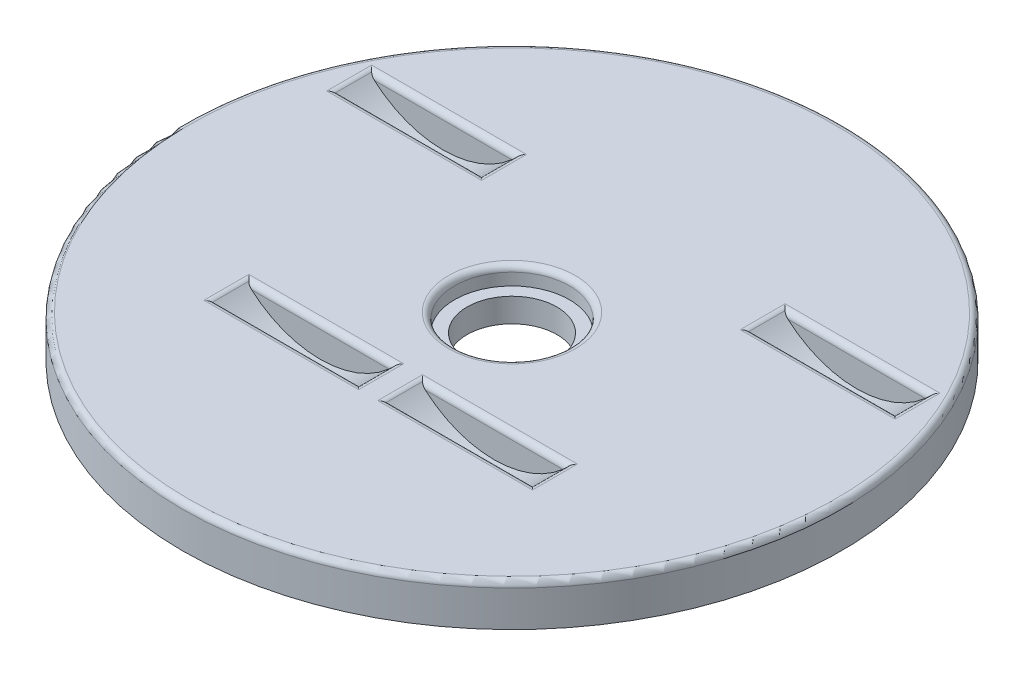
from build123d import *

# Parameters (mm, degrees)
SKETCH1_R          = 13.97
SKETCH1_R_2        = 1.905
EXTRUDE1_DEPTH     = 1.778
CUT_EXTRUDE1_DEPTH = 1.397
CUT_EXTRUDE2_DEPTH = 1.397
SKETCH5_R          = 2.43552708
CUT_EXTRUDE3_DEPTH = 0.762
EXTRUDE2_DEPTH     = 1.397
EXTRUDE3_DEPTH     = 1.397
FILLET1_R          = 0.254


with BuildPart() as part:
    # Sketch1 → Extrude1 (new body)
    with BuildSketch(Plane(origin=(0, 0, 0), x_dir=(1, 0, 0), z_dir=(0, 1, 0))):
        with Locations(Location((0, 0, 0), (0, 0, 270))):
            Circle(SKETCH1_R)
        with Locations(Location((0, 0, 0), (0, 0, 270))):
            Circle(SKETCH1_R_2, mode=Mode.SUBTRACT)
    extrude(amount=EXTRUDE1_DEPTH)

    # Sketch3 → Cut-Extrude1 (cut)
    with BuildSketch(Plane.XY.offset(5.842)):
        with BuildLine():
            Line((-0.508, 1.778), (-6.858, 1.778))
            ThreePointArc((-6.858, 1.778), (-3.683, 0.424758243), (-0.508, 1.778))
        make_face()
        with BuildLine():
            Line((0.508, 1.778), (6.858, 1.778))
            ThreePointArc((6.858, 1.778), (3.683, 0.424758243), (0.508, 1.778))
        make_face()
    extrude(amount=-CUT_EXTRUDE1_DEPTH, mode=Mode.SUBTRACT)

    # Sketch4 → Cut-Extrude2 (cut)
    with BuildSketch(Plane.XY.offset(-5.842)):
        with BuildLine():
            Line((-11.938, 1.778), (-5.588, 1.778))
            ThreePointArc((-5.588, 1.778), (-8.763, 0.424758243), (-11.938, 1.778))
        make_face()
        with BuildLine():
            Line((5.588, 1.778), (11.938, 1.778))
            ThreePointArc((11.938, 1.778), (8.763, 0.424758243), (5.588, 1.778))
        make_face()
    extrude(amount=CUT_EXTRUDE2_DEPTH, mode=Mode.SUBTRACT)

    # Sketch5 → Cut-Extrude3 (cut)
    with BuildSketch(Plane(origin=(0, 1.778, 0), x_dir=(-1, 0, 0), z_dir=(0, 1, 0))):
        with Locations(Location((0, 0, 0), (0, 0, 90))):
            Circle(SKETCH5_R)
    extrude(amount=-CUT_EXTRUDE3_DEPTH, mode=Mode.SUBTRACT)

    # Sketch9 → Extrude2 (add)
    with BuildSketch(Plane.XY.offset(5.842)):
        with BuildLine():
            Line((-0.508, 0), (-6.858, 0))
            ThreePointArc((-6.858, 0), (-3.683, -1.353241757), (-0.508, 0))
        make_face()
        with BuildLine():
            Line((0.508, 0), (6.858, 0))
            ThreePointArc((6.858, 0), (3.683, -1.353241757), (0.508, 0))
        make_face()
    extrude(amount=-EXTRUDE2_DEPTH)

    # Sketch10 → Extrude3 (add)
    with BuildSketch(Plane.XY.offset(-5.842)):
        with BuildLine():
            Line((5.588, 0), (11.938, 0))
            ThreePointArc((11.938, 0), (8.763, -1.353241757), (5.588, 0))
        make_face()
        with BuildLine():
            Line((-5.588, 0), (-11.938, 0))
            ThreePointArc((-11.938, 0), (-8.763, -1.353241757), (-5.588, 0))
        make_face()
    extrude(amount=EXTRUDE3_DEPTH)

    # Fillet1
    fillet1_edges = [part.edges().sort_by_distance(p)[0] for p in [
        (-0.508, 1.778, 5.1435),
        (-3.683, 1.778, 4.445),
        (-6.858, 1.778, 5.1435),
        (-3.683, 1.778, 5.842),
        (6.858, 1.778, 5.1435),
        (3.683, 1.778, 4.445),
        (0.508, 1.778, 5.1435),
        (3.683, 1.778, 5.842),
        (-11.938, 1.778, -5.1435),
        (-8.763, 1.778, -5.842),
        (-5.588, 1.778, -5.1435),
        (-8.763, 1.778, -4.445),
        (5.588, 1.778, -5.1435),
        (8.763, 1.778, -5.842),
        (11.938, 1.778, -5.1435),
        (8.763, 1.778, -4.445),
        (0, 1.778, -13.97),
        (0, 1.778, -2.43552708),
    ]]
    fillet(fillet1_edges, radius=FILLET1_R)


solid = part.part
